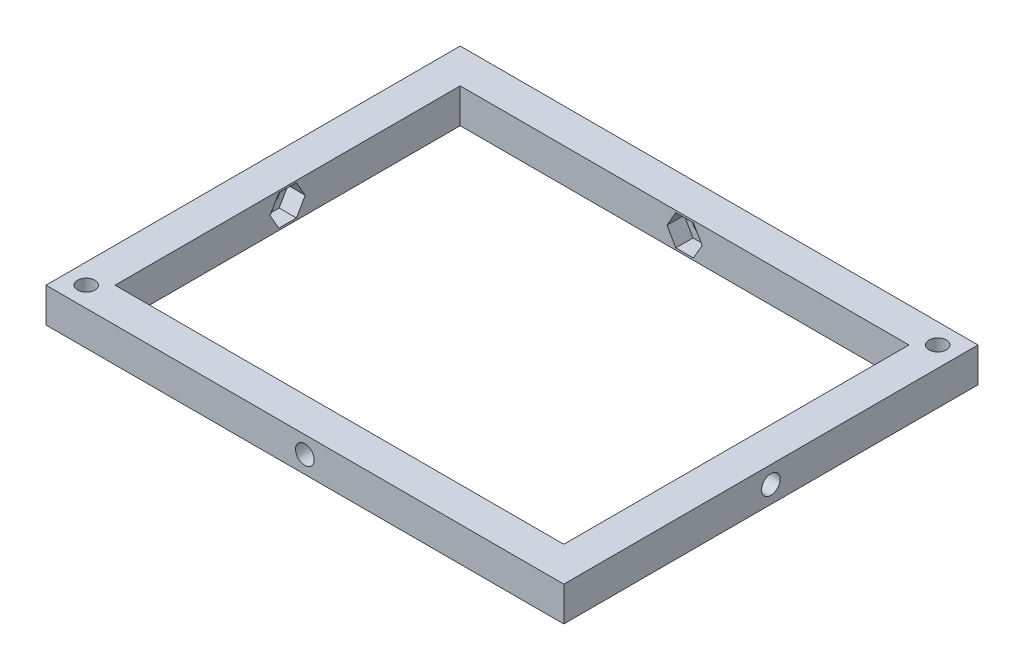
from build123d import *

# Parameters (mm, degrees)
CROQUIS1_W              = 90
CROQUIS1_H              = 72
SALIENTE_EXTRUIR1_DEPTH = 6
CROQUIS2_R              = 1.5
CROQUIS2_W              = 78
CROQUIS2_H              = 60
CORTAR_EXTRUIR1_DEPTH   = 58.939623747
CORTAR_EXTRUIR2_START   = -6
CORTAR_EXTRUIR2_DEPTH   = 3
CROQUIS4_R              = 1.625
CORTAR_EXTRUIR3_DEPTH   = 86.117565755
CROQUIS5_R              = 1.625
CORTAR_EXTRUIR4_DEPTH   = 98.118484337
CORTAR_EXTRUIR5_START   = -6
CROQUIS6_OUTSIDE_W      = 115.082
CROQUIS6_OUTSIDE_H      = 31.082
CROQUIS6_OUTSIDE_W_2    = 90
CROQUIS6_OUTSIDE_H_2    = 6
CORTAR_EXTRUIR5_DEPTH   = 3
CORTAR_EXTRUIR6_START   = -6
CORTAR_EXTRUIR6_DEPTH   = 3
CORTAR_EXTRUIR7_START   = -84
CORTAR_EXTRUIR7_DEPTH   = 3
CORTAR_EXTRUIR8_START   = -66
CROQUIS6_2_OUTSIDE_W    = 115.082
CROQUIS6_2_OUTSIDE_H    = 31.082
CROQUIS6_2_OUTSIDE_W_2  = 90
CROQUIS6_2_OUTSIDE_H_2  = 6
CORTAR_EXTRUIR8_DEPTH   = 3


with BuildPart() as part:
    # Croquis1 → Saliente-Extruir1 (new body)
    with BuildSketch(Plane(origin=(0, 0, 0), x_dir=(1, 0, 0), z_dir=(0, 1, 0))):
        Rectangle(CROQUIS1_W, CROQUIS1_H)
    extrude(amount=SALIENTE_EXTRUIR1_DEPTH)

    # Croquis2 → Cortar-Extruir1 (cut, through all)
    with BuildSketch(Plane(origin=(0, 6, 0), x_dir=(1, 0, 0), z_dir=(0, 1, 0))):
        with Locations(Location((-41.5, -32.5, 0), (0, 0, 270))):
            Circle(CROQUIS2_R)
        with Locations(Location((41.5, 32.5, 0), (0, 0, 270))):
            Circle(CROQUIS2_R)
        Rectangle(CROQUIS2_W, CROQUIS2_H)
    extrude(amount=-CORTAR_EXTRUIR1_DEPTH, mode=Mode.SUBTRACT)

    # Croquis3 → Cortar-Extruir2 (cut)
    with BuildSketch(Plane(origin=(0, 6, 0), x_dir=(1, 0, 0), z_dir=(0, 1, 0)).offset(CORTAR_EXTRUIR2_START)):
        Polygon((-39.970021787, -29.85), (-43.029978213, -29.85), (-44.559956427, -32.5), (-43.029978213, -35.15), (-39.970021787, -35.15), (-38.440043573, -32.5), align=None)
        Polygon((43.029978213, 35.15), (39.970021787, 35.15), (38.440043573, 32.5), (39.970021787, 29.85), (43.029978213, 29.85), (44.559956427, 32.5), align=None)
    extrude(amount=CORTAR_EXTRUIR2_DEPTH, mode=Mode.SUBTRACT)

    # Croquis4 → Cortar-Extruir3 (cut, through all)
    with BuildSketch(Plane.XY.offset(36)):
        with Locations((0, 3)):
            Circle(CROQUIS4_R)
    extrude(amount=-CORTAR_EXTRUIR3_DEPTH, mode=Mode.SUBTRACT)

    # Croquis5 → Cortar-Extruir4 (cut, through all)
    with BuildSketch(Plane(origin=(45, 0, 0), x_dir=(0, 0, -1), z_dir=(1, 0, 0))):
        with Locations((0, 3)):
            Circle(CROQUIS5_R)
    extrude(amount=-CORTAR_EXTRUIR4_DEPTH, mode=Mode.SUBTRACT)

    # Croquis6 outside → Cortar-Extruir5 (cut)
    # profile 1 of 2: a face of its own
    with BuildSketch(Plane.XY.offset(36).offset(CORTAR_EXTRUIR5_START)):
        with Locations((0, 3)):
            Rectangle(CROQUIS6_OUTSIDE_W, CROQUIS6_OUTSIDE_H)
        with Locations((0, 3)):
            Rectangle(CROQUIS6_OUTSIDE_W_2, CROQUIS6_OUTSIDE_H_2, mode=Mode.SUBTRACT)
    # profile 2 of 2: a face of its own
    with BuildSketch(Plane.XY.offset(36).offset(CORTAR_EXTRUIR5_START)):
        Polygon((1.529978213, 5.65), (-1.529978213, 5.65), (-3.059956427, 3), (-1.529978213, 0.35), (1.529978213, 0.35), (3.059956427, 3), align=None)
    extrude(amount=CORTAR_EXTRUIR5_DEPTH, mode=Mode.SUBTRACT)

    # Croquis8 → Cortar-Extruir6 (cut)
    with BuildSketch(Plane.ZY.offset(45).offset(CORTAR_EXTRUIR6_START)):
        Polygon((1.529978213, 5.65), (-1.529978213, 5.65), (-3.059956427, 3), (-1.529978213, 0.35), (1.529978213, 0.35), (3.059956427, 3), align=None)
    extrude(amount=CORTAR_EXTRUIR6_DEPTH, mode=Mode.SUBTRACT)

    # Croquis8_3 → Cortar-Extruir7 (cut)
    with BuildSketch(Plane.ZY.offset(45).offset(CORTAR_EXTRUIR7_START)):
        Polygon((1.529978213, 5.65), (-1.529978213, 5.65), (-3.059956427, 3), (-1.529978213, 0.35), (1.529978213, 0.35), (3.059956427, 3), align=None)
    extrude(amount=-CORTAR_EXTRUIR7_DEPTH, mode=Mode.SUBTRACT)

    # Croquis6_2 outside → Cortar-Extruir8 (cut)
    # profile 1 of 2: a face of its own
    with BuildSketch(Plane.XY.offset(36).offset(CORTAR_EXTRUIR8_START)):
        with Locations((0, 3)):
            Rectangle(CROQUIS6_2_OUTSIDE_W, CROQUIS6_2_OUTSIDE_H)
        with Locations((0, 3)):
            Rectangle(CROQUIS6_2_OUTSIDE_W_2, CROQUIS6_2_OUTSIDE_H_2, mode=Mode.SUBTRACT)
    # profile 2 of 2: a face of its own
    with BuildSketch(Plane.XY.offset(36).offset(CORTAR_EXTRUIR8_START)):
        Polygon((1.529978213, 5.65), (-1.529978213, 5.65), (-3.059956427, 3), (-1.529978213, 0.35), (1.529978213, 0.35), (3.059956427, 3), align=None)
    extrude(amount=-CORTAR_EXTRUIR8_DEPTH, mode=Mode.SUBTRACT)


solid = part.part
